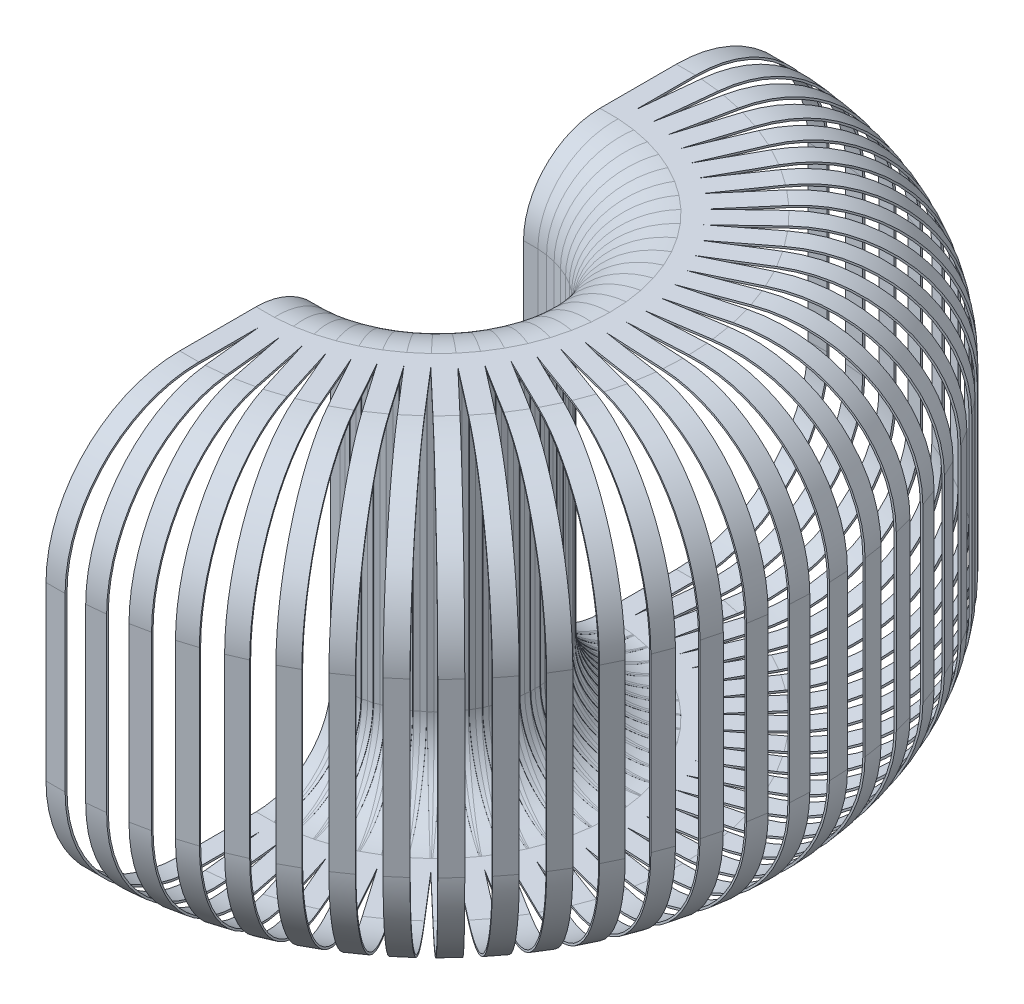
from build123d import *

# Parameters (mm, degrees)
SALIENTE_EXTRUIR1_DEPTH = 5
MATRIZC1_COUNT          = 32
MATRIZC1_ANGLE          = 180


with BuildPart() as part:
    # Croquis1 → Saliente-Extruir1 (new, symmetric)
    with BuildSketch(Plane(origin=(0, 0, 0), x_dir=(0, 0, -1), z_dir=(1, 0, 0))):
        with BuildLine():
            Line((200, 45), (200, -45))
            ThreePointArc((200, -45), (179.497474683, -94.497474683), (130, -115))
            Line((130, -115), (90, -115))
            ThreePointArc((90, -115), (61.715728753, -103.284271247), (50, -75))
            Line((50, -75), (50, 75))
            ThreePointArc((50, 75), (61.715728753, 103.284271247), (90, 115))
            Line((90, 115), (130, 115))
            ThreePointArc((130, 115), (179.497474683, 94.497474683), (200, 45))
        make_face()
        with BuildLine():
            Line((199, 45), (199, -45))
            ThreePointArc((199, -45), (178.790367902, -93.790367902), (130, -114))
            Line((130, -114), (90, -114))
            ThreePointArc((90, -114), (62.422835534, -102.577164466), (51, -75))
            Line((51, -75), (51, 75))
            ThreePointArc((51, 75), (62.422835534, 102.577164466), (90, 114))
            Line((90, 114), (130, 114))
            ThreePointArc((130, 114), (178.790367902, 93.790367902), (199, 45))
        make_face(mode=Mode.SUBTRACT)
    saliente_extruir1 = extrude(amount=SALIENTE_EXTRUIR1_DEPTH, both=True)

    # MatrizC1: Saliente-Extruir1 ×32 about axis
    matrizc1_axis = Axis((0, 0, 0), (0, -1, 0))
    for i in range(1, MATRIZC1_COUNT):
        add(saliente_extruir1.rotate(matrizc1_axis, i * MATRIZC1_ANGLE / (MATRIZC1_COUNT - 1)))


solid = part.part
